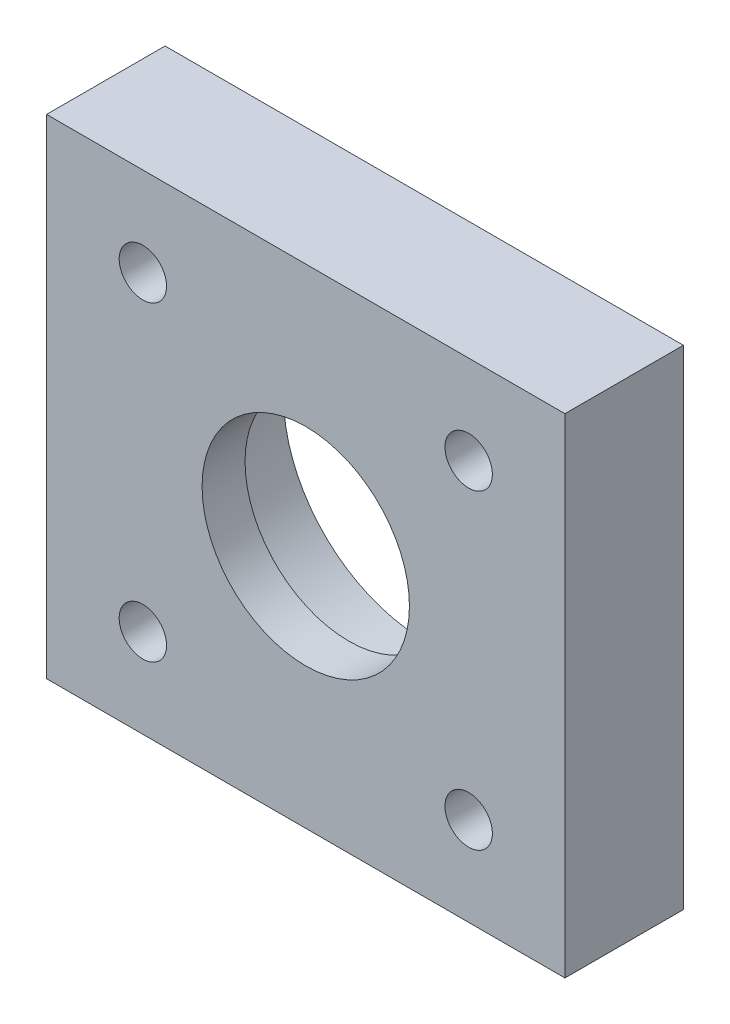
ISO-10303-21;
HEADER;
FILE_DESCRIPTION(('STEP AP214'),'2;1');
FILE_NAME('part.step','',(''),(''),'','','');
FILE_SCHEMA(('AUTOMOTIVE_DESIGN { 1 0 10303 214 1 1 1 1 }'));
ENDSEC;
DATA;
#1=APPLICATION_CONTEXT('core data for automotive mechanical design processes');
#2=APPLICATION_PROTOCOL_DEFINITION('international standard','automotive_design',2000,#1);
#3=PRODUCT_CONTEXT('',#1,'mechanical');
#4=PRODUCT('Part','Part','',(#3));
#5=PRODUCT_RELATED_PRODUCT_CATEGORY('part','',(#4));
#6=PRODUCT_DEFINITION_FORMATION('','',#4);
#7=PRODUCT_DEFINITION_CONTEXT('part definition',#1,'design');
#8=PRODUCT_DEFINITION('design','',#6,#7);
#9=PRODUCT_DEFINITION_SHAPE('','',#8);
#10=(LENGTH_UNIT() NAMED_UNIT(*) SI_UNIT(.MILLI.,.METRE.));
#11=(NAMED_UNIT(*) PLANE_ANGLE_UNIT() SI_UNIT($,.RADIAN.));
#12=(NAMED_UNIT(*) SI_UNIT($,.STERADIAN.) SOLID_ANGLE_UNIT());
#13=UNCERTAINTY_MEASURE_WITH_UNIT(LENGTH_MEASURE(1.E-05),#10,'distance_accuracy_value','');
#14=(GEOMETRIC_REPRESENTATION_CONTEXT(3) GLOBAL_UNCERTAINTY_ASSIGNED_CONTEXT((#13)) GLOBAL_UNIT_ASSIGNED_CONTEXT((#10,
#11,#12)) REPRESENTATION_CONTEXT('',''));
#15=CARTESIAN_POINT('',(0.,0.,0.));
#16=DIRECTION('',(0.,0.,1.));
#17=DIRECTION('',(1.,0.,0.));
#18=AXIS2_PLACEMENT_3D('',#15,#16,#17);
#19=CARTESIAN_POINT('',(0.,0.,8.));
#20=DIRECTION('',(0.,0.,1.));
#21=DIRECTION('',(1.,0.,0.));
#22=AXIS2_PLACEMENT_3D('',#19,#20,#21);
#23=PLANE('',#22);
#24=CARTESIAN_POINT('',(-8.9244680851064,-22.4595744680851,8.));
#25=DIRECTION('',(0.,0.,-1.));
#26=DIRECTION('',(-1.,0.,0.));
#27=AXIS2_PLACEMENT_3D('',#24,#25,#26);
#28=CIRCLE('',#27,1.6);
#29=CARTESIAN_POINT('',(-10.5244680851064,-22.4595744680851,8.));
#30=VERTEX_POINT('',#29);
#31=EDGE_CURVE('E126',#30,#30,#28,.F.);
#32=ORIENTED_EDGE('',*,*,#31,.F.);
#33=EDGE_LOOP('',(#32));
#34=FACE_BOUND('',#33,.T.);
#35=CARTESIAN_POINT('',(2.07553191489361,-11.9595744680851,8.));
#36=DIRECTION('',(0.,0.,-1.));
#37=DIRECTION('',(-1.,0.,0.));
#38=AXIS2_PLACEMENT_3D('',#35,#36,#37);
#39=CIRCLE('',#38,7.);
#40=CARTESIAN_POINT('',(-4.92446808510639,-11.9595744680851,8.));
#41=VERTEX_POINT('',#40);
#42=EDGE_CURVE('E116',#41,#41,#39,.T.);
#43=ORIENTED_EDGE('',*,*,#42,.T.);
#44=EDGE_LOOP('',(#43));
#45=FACE_BOUND('',#44,.T.);
#46=CARTESIAN_POINT('',(13.0755319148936,-1.45957446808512,8.));
#47=DIRECTION('',(0.,0.,-1.));
#48=DIRECTION('',(-1.,0.,0.));
#49=AXIS2_PLACEMENT_3D('',#46,#47,#48);
#50=CIRCLE('',#49,1.6);
#51=CARTESIAN_POINT('',(11.4755319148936,-1.45957446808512,8.));
#52=VERTEX_POINT('',#51);
#53=EDGE_CURVE('E113',#52,#52,#50,.T.);
#54=ORIENTED_EDGE('',*,*,#53,.T.);
#55=EDGE_LOOP('',(#54));
#56=FACE_BOUND('',#55,.T.);
#57=CARTESIAN_POINT('',(-8.92446808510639,-1.45957446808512,8.));
#58=DIRECTION('',(0.,0.,-1.));
#59=DIRECTION('',(-1.,0.,0.));
#60=AXIS2_PLACEMENT_3D('',#57,#58,#59);
#61=CIRCLE('',#60,1.6);
#62=CARTESIAN_POINT('',(-10.5244680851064,-1.45957446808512,8.));
#63=VERTEX_POINT('',#62);
#64=EDGE_CURVE('E120',#63,#63,#61,.F.);
#65=ORIENTED_EDGE('',*,*,#64,.F.);
#66=EDGE_LOOP('',(#65));
#67=FACE_BOUND('',#66,.T.);
#68=CARTESIAN_POINT('',(13.0755319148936,-22.4595744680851,8.));
#69=DIRECTION('',(0.,0.,-1.));
#70=DIRECTION('',(-1.,0.,0.));
#71=AXIS2_PLACEMENT_3D('',#68,#69,#70);
#72=CIRCLE('',#71,1.6);
#73=CARTESIAN_POINT('',(11.4755319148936,-22.4595744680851,8.));
#74=VERTEX_POINT('',#73);
#75=EDGE_CURVE('E132',#74,#74,#72,.T.);
#76=ORIENTED_EDGE('',*,*,#75,.T.);
#77=EDGE_LOOP('',(#76));
#78=FACE_BOUND('',#77,.T.);
#79=DIRECTION('',(0.,1.,0.));
#80=VECTOR('',#79,1.);
#81=CARTESIAN_POINT('',(19.5755319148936,0.,8.));
#82=LINE('',#81,#80);
#83=CARTESIAN_POINT('',(19.5755319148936,-28.4595744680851,8.));
#84=VERTEX_POINT('',#83);
#85=CARTESIAN_POINT('',(19.5755319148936,4.5404255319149,8.));
#86=VERTEX_POINT('',#85);
#87=EDGE_CURVE('E89',#84,#86,#82,.T.);
#88=ORIENTED_EDGE('',*,*,#87,.T.);
#89=DIRECTION('',(-1.,0.,0.));
#90=VECTOR('',#89,1.);
#91=CARTESIAN_POINT('',(0.,4.54042553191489,8.));
#92=LINE('',#91,#90);
#93=CARTESIAN_POINT('',(-15.4244680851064,4.54042553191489,8.));
#94=VERTEX_POINT('',#93);
#95=EDGE_CURVE('E52',#86,#94,#92,.T.);
#96=ORIENTED_EDGE('',*,*,#95,.T.);
#97=DIRECTION('',(0.,-1.,0.));
#98=VECTOR('',#97,1.);
#99=CARTESIAN_POINT('',(-15.4244680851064,0.,8.));
#100=LINE('',#99,#98);
#101=CARTESIAN_POINT('',(-15.4244680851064,-28.4595744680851,8.));
#102=VERTEX_POINT('',#101);
#103=EDGE_CURVE('E94',#94,#102,#100,.T.);
#104=ORIENTED_EDGE('',*,*,#103,.T.);
#105=DIRECTION('',(1.,0.,0.));
#106=VECTOR('',#105,1.);
#107=CARTESIAN_POINT('',(0.,-28.4595744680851,8.));
#108=LINE('',#107,#106);
#109=EDGE_CURVE('E80',#102,#84,#108,.T.);
#110=ORIENTED_EDGE('',*,*,#109,.T.);
#111=EDGE_LOOP('',(#88,#96,#104,#110));
#112=FACE_BOUND('',#111,.T.);
#113=ADVANCED_FACE('F37',(#34,#45,#56,#67,#78,#112),#23,.T.);
#114=CARTESIAN_POINT('',(0.,0.,0.));
#115=DIRECTION('',(0.,0.,1.));
#116=DIRECTION('',(1.,0.,0.));
#117=AXIS2_PLACEMENT_3D('',#114,#115,#116);
#118=PLANE('',#117);
#119=CARTESIAN_POINT('',(-8.9244680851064,-22.4595744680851,0.));
#120=DIRECTION('',(0.,0.,-1.));
#121=DIRECTION('',(-1.,0.,0.));
#122=AXIS2_PLACEMENT_3D('',#119,#120,#121);
#123=CIRCLE('',#122,1.6);
#124=CARTESIAN_POINT('',(-10.5244680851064,-22.4595744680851,0.));
#125=VERTEX_POINT('',#124);
#126=EDGE_CURVE('E129',#125,#125,#123,.F.);
#127=ORIENTED_EDGE('',*,*,#126,.T.);
#128=EDGE_LOOP('',(#127));
#129=FACE_BOUND('',#128,.T.);
#130=CARTESIAN_POINT('',(-8.92446808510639,-1.45957446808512,0.));
#131=DIRECTION('',(0.,0.,-1.));
#132=DIRECTION('',(-1.,0.,0.));
#133=AXIS2_PLACEMENT_3D('',#130,#131,#132);
#134=CIRCLE('',#133,1.6);
#135=CARTESIAN_POINT('',(-10.5244680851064,-1.45957446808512,0.));
#136=VERTEX_POINT('',#135);
#137=EDGE_CURVE('E123',#136,#136,#134,.F.);
#138=ORIENTED_EDGE('',*,*,#137,.T.);
#139=EDGE_LOOP('',(#138));
#140=FACE_BOUND('',#139,.T.);
#141=CARTESIAN_POINT('',(13.0755319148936,-1.45957446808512,0.));
#142=DIRECTION('',(0.,0.,-1.));
#143=DIRECTION('',(-1.,0.,0.));
#144=AXIS2_PLACEMENT_3D('',#141,#142,#143);
#145=CIRCLE('',#144,1.6);
#146=CARTESIAN_POINT('',(11.4755319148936,-1.45957446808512,0.));
#147=VERTEX_POINT('',#146);
#148=EDGE_CURVE('E117',#147,#147,#145,.T.);
#149=ORIENTED_EDGE('',*,*,#148,.F.);
#150=EDGE_LOOP('',(#149));
#151=FACE_BOUND('',#150,.T.);
#152=CARTESIAN_POINT('',(13.0755319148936,-22.4595744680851,0.));
#153=DIRECTION('',(0.,0.,-1.));
#154=DIRECTION('',(-1.,0.,0.));
#155=AXIS2_PLACEMENT_3D('',#152,#153,#154);
#156=CIRCLE('',#155,1.6);
#157=CARTESIAN_POINT('',(11.4755319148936,-22.4595744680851,0.));
#158=VERTEX_POINT('',#157);
#159=EDGE_CURVE('E110',#158,#158,#156,.T.);
#160=ORIENTED_EDGE('',*,*,#159,.F.);
#161=EDGE_LOOP('',(#160));
#162=FACE_BOUND('',#161,.T.);
#163=CARTESIAN_POINT('',(2.07553191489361,-11.9595744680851,0.));
#164=DIRECTION('',(0.,0.,-1.));
#165=DIRECTION('',(-1.,0.,0.));
#166=AXIS2_PLACEMENT_3D('',#163,#164,#165);
#167=CIRCLE('',#166,9.5);
#168=CARTESIAN_POINT('',(-7.42446808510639,-11.9595744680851,0.));
#169=VERTEX_POINT('',#168);
#170=EDGE_CURVE('E101',#169,#169,#167,.T.);
#171=ORIENTED_EDGE('',*,*,#170,.F.);
#172=EDGE_LOOP('',(#171));
#173=FACE_BOUND('',#172,.T.);
#174=DIRECTION('',(-1.,0.,0.));
#175=VECTOR('',#174,1.);
#176=CARTESIAN_POINT('',(0.,4.54042553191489,0.));
#177=LINE('',#176,#175);
#178=CARTESIAN_POINT('',(19.5755319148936,4.5404255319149,0.));
#179=VERTEX_POINT('',#178);
#180=CARTESIAN_POINT('',(-15.4244680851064,4.54042553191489,0.));
#181=VERTEX_POINT('',#180);
#182=EDGE_CURVE('E11',#179,#181,#177,.T.);
#183=ORIENTED_EDGE('',*,*,#182,.F.);
#184=DIRECTION('',(0.,1.,0.));
#185=VECTOR('',#184,1.);
#186=CARTESIAN_POINT('',(19.5755319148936,0.,0.));
#187=LINE('',#186,#185);
#188=CARTESIAN_POINT('',(19.5755319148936,-28.4595744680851,0.));
#189=VERTEX_POINT('',#188);
#190=EDGE_CURVE('E139',#189,#179,#187,.T.);
#191=ORIENTED_EDGE('',*,*,#190,.F.);
#192=DIRECTION('',(1.,0.,0.));
#193=VECTOR('',#192,1.);
#194=CARTESIAN_POINT('',(0.,-28.4595744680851,0.));
#195=LINE('',#194,#193);
#196=CARTESIAN_POINT('',(-15.4244680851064,-28.4595744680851,0.));
#197=VERTEX_POINT('',#196);
#198=EDGE_CURVE('E83',#197,#189,#195,.T.);
#199=ORIENTED_EDGE('',*,*,#198,.F.);
#200=DIRECTION('',(0.,-1.,0.));
#201=VECTOR('',#200,1.);
#202=CARTESIAN_POINT('',(-15.4244680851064,0.,0.));
#203=LINE('',#202,#201);
#204=EDGE_CURVE('E45',#181,#197,#203,.T.);
#205=ORIENTED_EDGE('',*,*,#204,.F.);
#206=EDGE_LOOP('',(#183,#191,#199,#205));
#207=FACE_BOUND('',#206,.T.);
#208=ADVANCED_FACE('F39',(#129,#140,#151,#162,#173,#207),#118,.F.);
#209=CARTESIAN_POINT('',(2.07553191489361,-11.9595744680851,8.));
#210=DIRECTION('',(0.,0.,-1.));
#211=DIRECTION('',(-1.,0.,0.));
#212=AXIS2_PLACEMENT_3D('',#209,#210,#211);
#213=CYLINDRICAL_SURFACE('',#212,7.);
#214=ORIENTED_EDGE('',*,*,#42,.F.);
#215=EDGE_LOOP('',(#214));
#216=FACE_BOUND('',#215,.T.);
#217=CARTESIAN_POINT('',(2.07553191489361,-11.9595744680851,5.1));
#218=DIRECTION('',(0.,0.,-1.));
#219=DIRECTION('',(-1.,0.,0.));
#220=AXIS2_PLACEMENT_3D('',#217,#218,#219);
#221=CIRCLE('',#220,7.);
#222=CARTESIAN_POINT('',(-4.92446808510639,-11.9595744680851,5.1));
#223=VERTEX_POINT('',#222);
#224=EDGE_CURVE('E104',#223,#223,#221,.T.);
#225=ORIENTED_EDGE('',*,*,#224,.T.);
#226=EDGE_LOOP('',(#225));
#227=FACE_BOUND('',#226,.T.);
#228=ADVANCED_FACE('F165',(#216,#227),#213,.F.);
#229=CARTESIAN_POINT('',(13.0755319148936,-1.45957446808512,8.));
#230=DIRECTION('',(0.,0.,-1.));
#231=DIRECTION('',(-1.,0.,0.));
#232=AXIS2_PLACEMENT_3D('',#229,#230,#231);
#233=CYLINDRICAL_SURFACE('',#232,1.6);
#234=ORIENTED_EDGE('',*,*,#53,.F.);
#235=EDGE_LOOP('',(#234));
#236=FACE_BOUND('',#235,.T.);
#237=ORIENTED_EDGE('',*,*,#148,.T.);
#238=EDGE_LOOP('',(#237));
#239=FACE_BOUND('',#238,.T.);
#240=ADVANCED_FACE('F172',(#236,#239),#233,.F.);
#241=CARTESIAN_POINT('',(-8.92446808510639,-1.45957446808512,8.));
#242=DIRECTION('',(0.,0.,-1.));
#243=DIRECTION('',(-1.,0.,0.));
#244=AXIS2_PLACEMENT_3D('',#241,#242,#243);
#245=CYLINDRICAL_SURFACE('',#244,1.6);
#246=ORIENTED_EDGE('',*,*,#64,.T.);
#247=EDGE_LOOP('',(#246));
#248=FACE_BOUND('',#247,.T.);
#249=ORIENTED_EDGE('',*,*,#137,.F.);
#250=EDGE_LOOP('',(#249));
#251=FACE_BOUND('',#250,.T.);
#252=ADVANCED_FACE('F181',(#248,#251),#245,.F.);
#253=CARTESIAN_POINT('',(-8.9244680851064,-22.4595744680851,8.));
#254=DIRECTION('',(0.,0.,-1.));
#255=DIRECTION('',(-1.,0.,0.));
#256=AXIS2_PLACEMENT_3D('',#253,#254,#255);
#257=CYLINDRICAL_SURFACE('',#256,1.6);
#258=ORIENTED_EDGE('',*,*,#31,.T.);
#259=EDGE_LOOP('',(#258));
#260=FACE_BOUND('',#259,.T.);
#261=ORIENTED_EDGE('',*,*,#126,.F.);
#262=EDGE_LOOP('',(#261));
#263=FACE_BOUND('',#262,.T.);
#264=ADVANCED_FACE('F177',(#260,#263),#257,.F.);
#265=CARTESIAN_POINT('',(13.0755319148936,-22.4595744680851,8.));
#266=DIRECTION('',(0.,0.,-1.));
#267=DIRECTION('',(-1.,0.,0.));
#268=AXIS2_PLACEMENT_3D('',#265,#266,#267);
#269=CYLINDRICAL_SURFACE('',#268,1.6);
#270=ORIENTED_EDGE('',*,*,#75,.F.);
#271=EDGE_LOOP('',(#270));
#272=FACE_BOUND('',#271,.T.);
#273=ORIENTED_EDGE('',*,*,#159,.T.);
#274=EDGE_LOOP('',(#273));
#275=FACE_BOUND('',#274,.T.);
#276=ADVANCED_FACE('F174',(#272,#275),#269,.F.);
#277=CARTESIAN_POINT('',(2.07553191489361,-11.9595744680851,5.1));
#278=DIRECTION('',(0.,0.,-1.));
#279=DIRECTION('',(-1.,0.,0.));
#280=AXIS2_PLACEMENT_3D('',#277,#278,#279);
#281=CYLINDRICAL_SURFACE('',#280,9.5);
#282=CARTESIAN_POINT('',(2.07553191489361,-11.9595744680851,5.1));
#283=DIRECTION('',(0.,0.,-1.));
#284=DIRECTION('',(-1.,0.,0.));
#285=AXIS2_PLACEMENT_3D('',#282,#283,#284);
#286=CIRCLE('',#285,9.5);
#287=CARTESIAN_POINT('',(-7.42446808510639,-11.9595744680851,5.1));
#288=VERTEX_POINT('',#287);
#289=EDGE_CURVE('E107',#288,#288,#286,.T.);
#290=ORIENTED_EDGE('',*,*,#289,.F.);
#291=EDGE_LOOP('',(#290));
#292=FACE_BOUND('',#291,.T.);
#293=ORIENTED_EDGE('',*,*,#170,.T.);
#294=EDGE_LOOP('',(#293));
#295=FACE_BOUND('',#294,.T.);
#296=ADVANCED_FACE('F156',(#292,#295),#281,.F.);
#297=CARTESIAN_POINT('',(0.,0.,5.1));
#298=DIRECTION('',(0.,0.,-1.));
#299=DIRECTION('',(-1.,0.,0.));
#300=AXIS2_PLACEMENT_3D('',#297,#298,#299);
#301=PLANE('',#300);
#302=ORIENTED_EDGE('',*,*,#224,.F.);
#303=EDGE_LOOP('',(#302));
#304=FACE_BOUND('',#303,.T.);
#305=ORIENTED_EDGE('',*,*,#289,.T.);
#306=EDGE_LOOP('',(#305));
#307=FACE_BOUND('',#306,.T.);
#308=ADVANCED_FACE('F149',(#304,#307),#301,.T.);
#309=CARTESIAN_POINT('',(0.,4.54042553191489,-2.));
#310=DIRECTION('',(0.,1.,0.));
#311=DIRECTION('',(-1.,0.,0.));
#312=AXIS2_PLACEMENT_3D('',#309,#310,#311);
#313=PLANE('',#312);
#314=ORIENTED_EDGE('',*,*,#182,.T.);
#315=DIRECTION('',(0.,0.,1.));
#316=VECTOR('',#315,1.);
#317=CARTESIAN_POINT('',(-15.4244680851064,4.54042553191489,-2.));
#318=LINE('',#317,#316);
#319=EDGE_CURVE('E99',#181,#94,#318,.T.);
#320=ORIENTED_EDGE('',*,*,#319,.T.);
#321=ORIENTED_EDGE('',*,*,#95,.F.);
#322=DIRECTION('',(0.,0.,1.));
#323=VECTOR('',#322,1.);
#324=CARTESIAN_POINT('',(19.5755319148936,4.5404255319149,-2.));
#325=LINE('',#324,#323);
#326=EDGE_CURVE('E86',#179,#86,#325,.T.);
#327=ORIENTED_EDGE('',*,*,#326,.F.);
#328=EDGE_LOOP('',(#314,#320,#321,#327));
#329=FACE_BOUND('',#328,.T.);
#330=ADVANCED_FACE('F147',(#329),#313,.T.);
#331=CARTESIAN_POINT('',(-15.4244680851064,0.,-2.));
#332=DIRECTION('',(-1.,0.,0.));
#333=DIRECTION('',(0.,-1.,0.));
#334=AXIS2_PLACEMENT_3D('',#331,#332,#333);
#335=PLANE('',#334);
#336=ORIENTED_EDGE('',*,*,#204,.T.);
#337=DIRECTION('',(0.,0.,1.));
#338=VECTOR('',#337,1.);
#339=CARTESIAN_POINT('',(-15.4244680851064,-28.4595744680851,-2.));
#340=LINE('',#339,#338);
#341=EDGE_CURVE('E85',#197,#102,#340,.T.);
#342=ORIENTED_EDGE('',*,*,#341,.T.);
#343=ORIENTED_EDGE('',*,*,#103,.F.);
#344=ORIENTED_EDGE('',*,*,#319,.F.);
#345=EDGE_LOOP('',(#336,#342,#343,#344));
#346=FACE_BOUND('',#345,.T.);
#347=ADVANCED_FACE('F144',(#346),#335,.T.);
#348=CARTESIAN_POINT('',(0.,-28.4595744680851,-2.));
#349=DIRECTION('',(0.,-1.,0.));
#350=DIRECTION('',(1.,0.,0.));
#351=AXIS2_PLACEMENT_3D('',#348,#349,#350);
#352=PLANE('',#351);
#353=ORIENTED_EDGE('',*,*,#198,.T.);
#354=DIRECTION('',(0.,0.,1.));
#355=VECTOR('',#354,1.);
#356=CARTESIAN_POINT('',(19.5755319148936,-28.4595744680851,-2.));
#357=LINE('',#356,#355);
#358=EDGE_CURVE('E60',#189,#84,#357,.T.);
#359=ORIENTED_EDGE('',*,*,#358,.T.);
#360=ORIENTED_EDGE('',*,*,#109,.F.);
#361=ORIENTED_EDGE('',*,*,#341,.F.);
#362=EDGE_LOOP('',(#353,#359,#360,#361));
#363=FACE_BOUND('',#362,.T.);
#364=ADVANCED_FACE('F77',(#363),#352,.T.);
#365=CARTESIAN_POINT('',(19.5755319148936,0.,-2.));
#366=DIRECTION('',(1.,0.,0.));
#367=DIRECTION('',(0.,0.,-1.));
#368=AXIS2_PLACEMENT_3D('',#365,#366,#367);
#369=PLANE('',#368);
#370=ORIENTED_EDGE('',*,*,#190,.T.);
#371=ORIENTED_EDGE('',*,*,#326,.T.);
#372=ORIENTED_EDGE('',*,*,#87,.F.);
#373=ORIENTED_EDGE('',*,*,#358,.F.);
#374=EDGE_LOOP('',(#370,#371,#372,#373));
#375=FACE_BOUND('',#374,.T.);
#376=ADVANCED_FACE('F90',(#375),#369,.T.);
#377=CLOSED_SHELL('',(#113,#208,#228,#240,#252,#264,#276,#296,#308,#330,#347,#364,#376));
#378=MANIFOLD_SOLID_BREP('B2',#377);
#379=ADVANCED_BREP_SHAPE_REPRESENTATION('',(#18,#378),#14);
#380=SHAPE_DEFINITION_REPRESENTATION(#9,#379);
ENDSEC;
END-ISO-10303-21;
